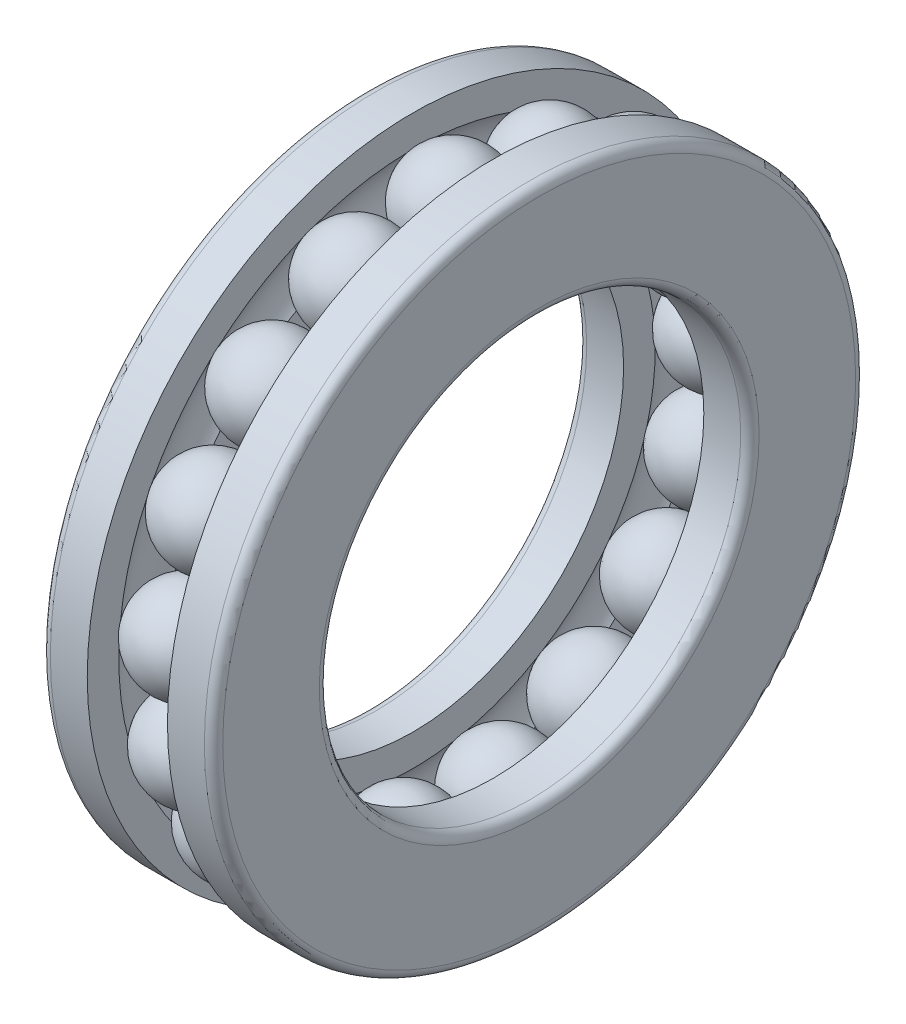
from build123d import *

# Parameters (mm, degrees)
BALLSDETAILED_COUNT = 17
BALLSDETAILED_ANGLE = 338.823529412


with BuildPart() as part:
    # InnRacSke → Race (revolve)
    with BuildSketch(Plane.XY, mode=Mode.PRIVATE) as race_sk:
        with BuildLine():
            Line((-6.6468625, 40.157346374), (-6.6468625, 34.925))
            Line((-6.6468625, 34.925), (-12.7635, 34.925))
            ThreePointArc((-12.7635, 34.925), (-13.841130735, 35.371369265), (-14.2875, 36.449))
            Line((-14.2875, 36.449), (-14.2875, 52.451))
            ThreePointArc((-14.2875, 52.451), (-13.841130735, 53.528630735), (-12.7635, 53.975))
            Line((-12.7635, 53.975), (-6.6468625, 53.975))
            Line((-6.6468625, 53.975), (-6.6468625, 48.742653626))
            ThreePointArc((-6.6468625, 48.742653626), (-7.9125, 44.45), (-6.6468625, 40.157346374))
        make_face()
    race = revolve(race_sk.sketch.rotate(Axis((-34.925, 0, 0), (1, 0, 0)), 270), axis=Axis((-34.925, 0, 0), (1, 0, 0)))

    # BalDetSke → BallDetailed (revolve)
    with BuildSketch(Plane.XY):
        with BuildLine():
            Line((-7.9375, 44.45), (7.9375, 44.45))
            ThreePointArc((7.9375, 44.45), (0, 36.5125), (-7.9375, 44.45))
        make_face()
    balldetailed = revolve(axis=Axis((-14.57325, 44.45, 0), (1, 0, 0)))

    # Mirror1: Race across plane
    add(race.mirror(Plane(origin=(0, 0, 0), x_dir=(0, 0, 1), z_dir=(1, 0, 0))))

    # BallsDetailed: BallDetailed ×17 about axis
    ballsdetailed_axis = Axis((-50, 0, 0), (1, 0, 0))
    for i in range(1, BALLSDETAILED_COUNT):
        add(balldetailed.rotate(ballsdetailed_axis, i * BALLSDETAILED_ANGLE / (BALLSDETAILED_COUNT - 1)))


solid = part.part
